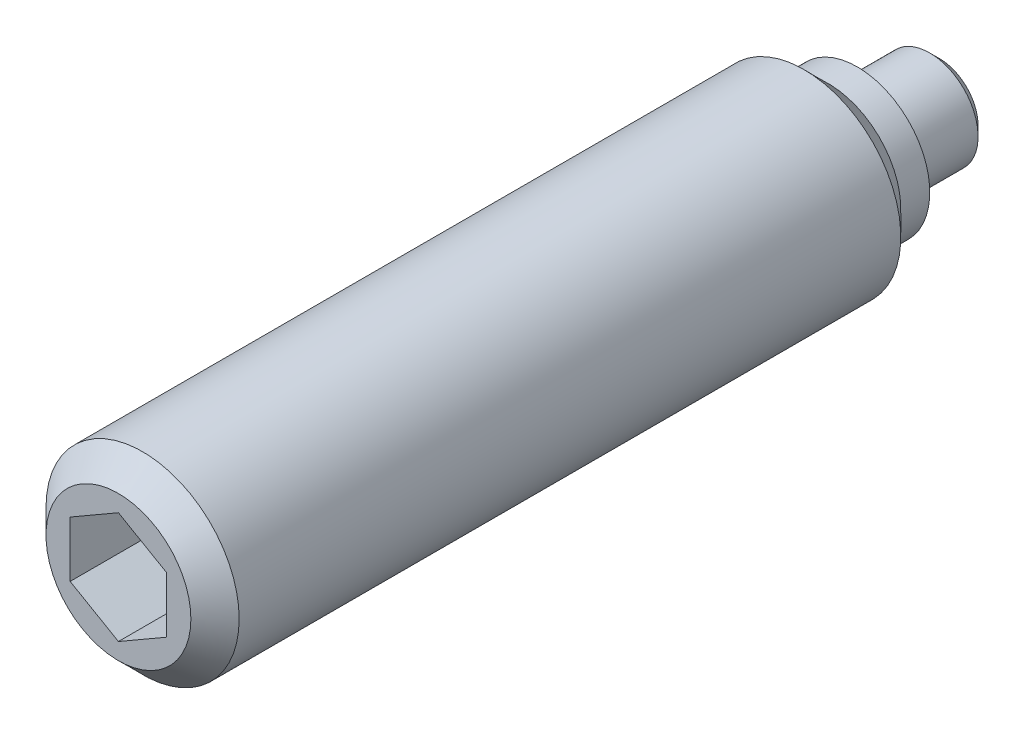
ISO-10303-21;
HEADER;
FILE_DESCRIPTION(('STEP AP214'),'2;1');
FILE_NAME('part.step','',(''),(''),'','','');
FILE_SCHEMA(('AUTOMOTIVE_DESIGN { 1 0 10303 214 1 1 1 1 }'));
ENDSEC;
DATA;
#1=APPLICATION_CONTEXT('core data for automotive mechanical design processes');
#2=APPLICATION_PROTOCOL_DEFINITION('international standard','automotive_design',2000,#1);
#3=PRODUCT_CONTEXT('',#1,'mechanical');
#4=PRODUCT('Part','Part','',(#3));
#5=PRODUCT_RELATED_PRODUCT_CATEGORY('part','',(#4));
#6=PRODUCT_DEFINITION_FORMATION('','',#4);
#7=PRODUCT_DEFINITION_CONTEXT('part definition',#1,'design');
#8=PRODUCT_DEFINITION('design','',#6,#7);
#9=PRODUCT_DEFINITION_SHAPE('','',#8);
#10=(LENGTH_UNIT() NAMED_UNIT(*) SI_UNIT(.MILLI.,.METRE.));
#11=(NAMED_UNIT(*) PLANE_ANGLE_UNIT() SI_UNIT($,.RADIAN.));
#12=(NAMED_UNIT(*) SI_UNIT($,.STERADIAN.) SOLID_ANGLE_UNIT());
#13=UNCERTAINTY_MEASURE_WITH_UNIT(LENGTH_MEASURE(1.E-05),#10,'distance_accuracy_value','');
#14=(GEOMETRIC_REPRESENTATION_CONTEXT(3) GLOBAL_UNCERTAINTY_ASSIGNED_CONTEXT((#13)) GLOBAL_UNIT_ASSIGNED_CONTEXT((#10,
#11,#12)) REPRESENTATION_CONTEXT('',''));
#15=CARTESIAN_POINT('',(0.,0.,0.));
#16=DIRECTION('',(0.,0.,1.));
#17=DIRECTION('',(1.,0.,0.));
#18=AXIS2_PLACEMENT_3D('',#15,#16,#17);
#19=CARTESIAN_POINT('',(0.,0.,0.));
#20=DIRECTION('',(0.,0.,-1.));
#21=DIRECTION('',(-1.,0.,0.));
#22=AXIS2_PLACEMENT_3D('',#19,#20,#21);
#23=CYLINDRICAL_SURFACE('',#22,1.);
#24=CARTESIAN_POINT('',(0.,0.,0.2));
#25=DIRECTION('',(0.,0.,-1.));
#26=DIRECTION('',(-1.,0.,0.));
#27=AXIS2_PLACEMENT_3D('',#24,#25,#26);
#28=CIRCLE('',#27,1.);
#29=CARTESIAN_POINT('',(-1.,0.,0.2));
#30=VERTEX_POINT('',#29);
#31=EDGE_CURVE('E133',#30,#30,#28,.T.);
#32=ORIENTED_EDGE('',*,*,#31,.F.);
#33=EDGE_LOOP('',(#32));
#34=FACE_BOUND('',#33,.T.);
#35=CARTESIAN_POINT('',(0.,0.,1.7));
#36=DIRECTION('',(0.,0.,-1.));
#37=DIRECTION('',(-1.,0.,0.));
#38=AXIS2_PLACEMENT_3D('',#35,#36,#37);
#39=CIRCLE('',#38,1.);
#40=CARTESIAN_POINT('',(-1.,0.,1.7));
#41=VERTEX_POINT('',#40);
#42=EDGE_CURVE('E127',#41,#41,#39,.T.);
#43=ORIENTED_EDGE('',*,*,#42,.T.);
#44=EDGE_LOOP('',(#43));
#45=FACE_BOUND('',#44,.T.);
#46=ADVANCED_FACE('F14',(#34,#45),#23,.T.);
#47=CARTESIAN_POINT('',(0.,0.,0.2));
#48=DIRECTION('',(0.,0.,1.));
#49=DIRECTION('',(1.,0.,0.));
#50=AXIS2_PLACEMENT_3D('',#47,#48,#49);
#51=CONICAL_SURFACE('',#50,1.,0.785398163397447);
#52=CARTESIAN_POINT('',(0.,0.,0.));
#53=DIRECTION('',(0.,0.,-1.));
#54=DIRECTION('',(-1.,0.,0.));
#55=AXIS2_PLACEMENT_3D('',#52,#53,#54);
#56=CIRCLE('',#55,0.8);
#57=CARTESIAN_POINT('',(-0.8,0.,0.));
#58=VERTEX_POINT('',#57);
#59=EDGE_CURVE('E130',#58,#58,#56,.T.);
#60=ORIENTED_EDGE('',*,*,#59,.F.);
#61=EDGE_LOOP('',(#60));
#62=FACE_BOUND('',#61,.T.);
#63=ORIENTED_EDGE('',*,*,#31,.T.);
#64=EDGE_LOOP('',(#63));
#65=FACE_BOUND('',#64,.T.);
#66=ADVANCED_FACE('F157',(#62,#65),#51,.T.);
#67=CARTESIAN_POINT('',(0.,0.8,0.));
#68=DIRECTION('',(0.,0.,1.));
#69=DIRECTION('',(1.,0.,0.));
#70=AXIS2_PLACEMENT_3D('',#67,#68,#69);
#71=PLANE('',#70);
#72=ORIENTED_EDGE('',*,*,#59,.T.);
#73=EDGE_LOOP('',(#72));
#74=FACE_BOUND('',#73,.T.);
#75=ADVANCED_FACE('F154',(#74),#71,.F.);
#76=CARTESIAN_POINT('',(0.,0.,1.7));
#77=DIRECTION('',(0.,0.,-1.));
#78=DIRECTION('',(-1.,0.,0.));
#79=AXIS2_PLACEMENT_3D('',#76,#77,#78);
#80=CYLINDRICAL_SURFACE('',#79,2.);
#81=CARTESIAN_POINT('',(0.,0.,2.8));
#82=DIRECTION('',(0.,0.,-1.));
#83=DIRECTION('',(-1.,0.,0.));
#84=AXIS2_PLACEMENT_3D('',#81,#82,#83);
#85=CIRCLE('',#84,2.);
#86=CARTESIAN_POINT('',(-2.,0.,2.8));
#87=VERTEX_POINT('',#86);
#88=EDGE_CURVE('E9',#87,#87,#85,.T.);
#89=ORIENTED_EDGE('',*,*,#88,.F.);
#90=EDGE_LOOP('',(#89));
#91=FACE_BOUND('',#90,.T.);
#92=CARTESIAN_POINT('',(0.,0.,16.5));
#93=DIRECTION('',(0.,0.,1.));
#94=DIRECTION('',(1.,0.,0.));
#95=AXIS2_PLACEMENT_3D('',#92,#93,#94);
#96=CIRCLE('',#95,2.);
#97=CARTESIAN_POINT('',(2.,0.,16.5));
#98=VERTEX_POINT('',#97);
#99=EDGE_CURVE('E124',#98,#98,#96,.T.);
#100=ORIENTED_EDGE('',*,*,#99,.F.);
#101=EDGE_LOOP('',(#100));
#102=FACE_BOUND('',#101,.T.);
#103=ADVANCED_FACE('F16',(#91,#102),#80,.T.);
#104=CARTESIAN_POINT('',(0.,0.,2.8));
#105=DIRECTION('',(0.,0.,1.));
#106=DIRECTION('',(1.,0.,0.));
#107=AXIS2_PLACEMENT_3D('',#104,#105,#106);
#108=CONICAL_SURFACE('',#107,2.,0.785398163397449);
#109=ORIENTED_EDGE('',*,*,#88,.T.);
#110=EDGE_LOOP('',(#109));
#111=FACE_BOUND('',#110,.T.);
#112=CARTESIAN_POINT('',(0.,0.,2.3));
#113=DIRECTION('',(0.,0.,-1.));
#114=DIRECTION('',(-1.,0.,0.));
#115=AXIS2_PLACEMENT_3D('',#112,#113,#114);
#116=CIRCLE('',#115,1.5);
#117=CARTESIAN_POINT('',(-1.5,0.,2.3));
#118=VERTEX_POINT('',#117);
#119=EDGE_CURVE('E22',#118,#118,#116,.T.);
#120=ORIENTED_EDGE('',*,*,#119,.F.);
#121=EDGE_LOOP('',(#120));
#122=FACE_BOUND('',#121,.T.);
#123=ADVANCED_FACE('F143',(#111,#122),#108,.T.);
#124=CARTESIAN_POINT('',(0.,0.,1.7));
#125=DIRECTION('',(0.,0.,-1.));
#126=DIRECTION('',(-1.,0.,0.));
#127=AXIS2_PLACEMENT_3D('',#124,#125,#126);
#128=CYLINDRICAL_SURFACE('',#127,1.5);
#129=CARTESIAN_POINT('',(0.,0.,1.7));
#130=DIRECTION('',(0.,0.,-1.));
#131=DIRECTION('',(-1.,0.,0.));
#132=AXIS2_PLACEMENT_3D('',#129,#130,#131);
#133=CIRCLE('',#132,1.5);
#134=CARTESIAN_POINT('',(-1.5,0.,1.7));
#135=VERTEX_POINT('',#134);
#136=EDGE_CURVE('E136',#135,#135,#133,.T.);
#137=ORIENTED_EDGE('',*,*,#136,.F.);
#138=EDGE_LOOP('',(#137));
#139=FACE_BOUND('',#138,.T.);
#140=ORIENTED_EDGE('',*,*,#119,.T.);
#141=EDGE_LOOP('',(#140));
#142=FACE_BOUND('',#141,.T.);
#143=ADVANCED_FACE('F141',(#139,#142),#128,.T.);
#144=CARTESIAN_POINT('',(0.,1.5,1.7));
#145=DIRECTION('',(0.,0.,1.));
#146=DIRECTION('',(1.,0.,0.));
#147=AXIS2_PLACEMENT_3D('',#144,#145,#146);
#148=PLANE('',#147);
#149=ORIENTED_EDGE('',*,*,#136,.T.);
#150=EDGE_LOOP('',(#149));
#151=FACE_BOUND('',#150,.T.);
#152=ORIENTED_EDGE('',*,*,#42,.F.);
#153=EDGE_LOOP('',(#152));
#154=FACE_BOUND('',#153,.T.);
#155=ADVANCED_FACE('F151',(#151,#154),#148,.F.);
#156=CARTESIAN_POINT('',(0.,-1.5,17.));
#157=DIRECTION('',(0.,0.,1.));
#158=DIRECTION('',(1.,0.,0.));
#159=AXIS2_PLACEMENT_3D('',#156,#157,#158);
#160=PLANE('',#159);
#161=DIRECTION('',(0.866025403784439,-0.5,0.));
#162=VECTOR('',#161,1.);
#163=CARTESIAN_POINT('',(-1.,-0.577350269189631,17.));
#164=LINE('',#163,#162);
#165=CARTESIAN_POINT('',(-1.,-0.577350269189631,17.));
#166=VERTEX_POINT('',#165);
#167=CARTESIAN_POINT('',(0.,-1.15470053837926,17.));
#168=VERTEX_POINT('',#167);
#169=EDGE_CURVE('E29',#166,#168,#164,.T.);
#170=ORIENTED_EDGE('',*,*,#169,.F.);
#171=DIRECTION('',(0.,-1.,0.));
#172=VECTOR('',#171,1.);
#173=CARTESIAN_POINT('',(-1.,0.577350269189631,17.));
#174=LINE('',#173,#172);
#175=CARTESIAN_POINT('',(-1.,0.577350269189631,17.));
#176=VERTEX_POINT('',#175);
#177=EDGE_CURVE('E112',#176,#166,#174,.T.);
#178=ORIENTED_EDGE('',*,*,#177,.F.);
#179=DIRECTION('',(-0.866025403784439,-0.5,0.));
#180=VECTOR('',#179,1.);
#181=CARTESIAN_POINT('',(0.,1.15470053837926,17.));
#182=LINE('',#181,#180);
#183=CARTESIAN_POINT('',(0.,1.15470053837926,17.));
#184=VERTEX_POINT('',#183);
#185=EDGE_CURVE('E110',#184,#176,#182,.T.);
#186=ORIENTED_EDGE('',*,*,#185,.F.);
#187=DIRECTION('',(-0.866025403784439,0.5,0.));
#188=VECTOR('',#187,1.);
#189=CARTESIAN_POINT('',(1.,0.577350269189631,17.));
#190=LINE('',#189,#188);
#191=CARTESIAN_POINT('',(1.,0.577350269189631,17.));
#192=VERTEX_POINT('',#191);
#193=EDGE_CURVE('E77',#192,#184,#190,.T.);
#194=ORIENTED_EDGE('',*,*,#193,.F.);
#195=DIRECTION('',(0.,1.,0.));
#196=VECTOR('',#195,1.);
#197=CARTESIAN_POINT('',(1.,-0.577350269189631,17.));
#198=LINE('',#197,#196);
#199=CARTESIAN_POINT('',(1.,-0.577350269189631,17.));
#200=VERTEX_POINT('',#199);
#201=EDGE_CURVE('E106',#200,#192,#198,.T.);
#202=ORIENTED_EDGE('',*,*,#201,.F.);
#203=DIRECTION('',(0.866025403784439,0.5,0.));
#204=VECTOR('',#203,1.);
#205=CARTESIAN_POINT('',(0.,-1.15470053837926,17.));
#206=LINE('',#205,#204);
#207=EDGE_CURVE('E103',#168,#200,#206,.T.);
#208=ORIENTED_EDGE('',*,*,#207,.F.);
#209=EDGE_LOOP('',(#170,#178,#186,#194,#202,#208));
#210=FACE_BOUND('',#209,.T.);
#211=CARTESIAN_POINT('',(0.,0.,17.));
#212=DIRECTION('',(0.,0.,1.));
#213=DIRECTION('',(1.,0.,0.));
#214=AXIS2_PLACEMENT_3D('',#211,#212,#213);
#215=CIRCLE('',#214,1.5);
#216=CARTESIAN_POINT('',(1.5,0.,17.));
#217=VERTEX_POINT('',#216);
#218=EDGE_CURVE('E116',#217,#217,#215,.T.);
#219=ORIENTED_EDGE('',*,*,#218,.T.);
#220=EDGE_LOOP('',(#219));
#221=FACE_BOUND('',#220,.T.);
#222=ADVANCED_FACE('F170',(#210,#221),#160,.T.);
#223=CARTESIAN_POINT('',(0.,0.,17.));
#224=DIRECTION('',(0.,0.,-1.));
#225=DIRECTION('',(-1.,0.,0.));
#226=AXIS2_PLACEMENT_3D('',#223,#224,#225);
#227=CONICAL_SURFACE('',#226,1.5,0.785398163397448);
#228=ORIENTED_EDGE('',*,*,#99,.T.);
#229=EDGE_LOOP('',(#228));
#230=FACE_BOUND('',#229,.T.);
#231=ORIENTED_EDGE('',*,*,#218,.F.);
#232=EDGE_LOOP('',(#231));
#233=FACE_BOUND('',#232,.T.);
#234=ADVANCED_FACE('F175',(#230,#233),#227,.T.);
#235=CARTESIAN_POINT('',(-1.,-0.577350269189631,14.5));
#236=DIRECTION('',(-0.5,-0.866025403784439,0.));
#237=DIRECTION('',(0.866025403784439,-0.5,0.));
#238=AXIS2_PLACEMENT_3D('',#235,#236,#237);
#239=PLANE('',#238);
#240=ORIENTED_EDGE('',*,*,#169,.T.);
#241=DIRECTION('',(0.,0.,1.));
#242=VECTOR('',#241,1.);
#243=CARTESIAN_POINT('',(0.,-1.15470053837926,14.5));
#244=LINE('',#243,#242);
#245=CARTESIAN_POINT('',(0.,-1.15470053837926,14.5));
#246=VERTEX_POINT('',#245);
#247=EDGE_CURVE('E59',#246,#168,#244,.T.);
#248=ORIENTED_EDGE('',*,*,#247,.F.);
#249=DIRECTION('',(0.866025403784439,-0.5,0.));
#250=VECTOR('',#249,1.);
#251=CARTESIAN_POINT('',(-1.,-0.577350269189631,14.5));
#252=LINE('',#251,#250);
#253=CARTESIAN_POINT('',(-1.,-0.577350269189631,14.5));
#254=VERTEX_POINT('',#253);
#255=EDGE_CURVE('E114',#254,#246,#252,.T.);
#256=ORIENTED_EDGE('',*,*,#255,.F.);
#257=DIRECTION('',(0.,0.,1.));
#258=VECTOR('',#257,1.);
#259=CARTESIAN_POINT('',(-1.,-0.577350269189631,14.5));
#260=LINE('',#259,#258);
#261=EDGE_CURVE('E37',#254,#166,#260,.T.);
#262=ORIENTED_EDGE('',*,*,#261,.T.);
#263=EDGE_LOOP('',(#240,#248,#256,#262));
#264=FACE_BOUND('',#263,.T.);
#265=ADVANCED_FACE('F184',(#264),#239,.F.);
#266=CARTESIAN_POINT('',(-1.,0.577350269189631,14.5));
#267=DIRECTION('',(-1.,0.,0.));
#268=DIRECTION('',(0.,0.,1.));
#269=AXIS2_PLACEMENT_3D('',#266,#267,#268);
#270=PLANE('',#269);
#271=ORIENTED_EDGE('',*,*,#177,.T.);
#272=ORIENTED_EDGE('',*,*,#261,.F.);
#273=DIRECTION('',(0.,-1.,0.));
#274=VECTOR('',#273,1.);
#275=CARTESIAN_POINT('',(-1.,0.577350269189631,14.5));
#276=LINE('',#275,#274);
#277=CARTESIAN_POINT('',(-1.,0.577350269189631,14.5));
#278=VERTEX_POINT('',#277);
#279=EDGE_CURVE('E89',#278,#254,#276,.T.);
#280=ORIENTED_EDGE('',*,*,#279,.F.);
#281=DIRECTION('',(0.,0.,1.));
#282=VECTOR('',#281,1.);
#283=CARTESIAN_POINT('',(-1.,0.577350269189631,14.5));
#284=LINE('',#283,#282);
#285=EDGE_CURVE('E81',#278,#176,#284,.T.);
#286=ORIENTED_EDGE('',*,*,#285,.T.);
#287=EDGE_LOOP('',(#271,#272,#280,#286));
#288=FACE_BOUND('',#287,.T.);
#289=ADVANCED_FACE('F244',(#288),#270,.F.);
#290=CARTESIAN_POINT('',(0.,1.15470053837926,14.5));
#291=DIRECTION('',(-0.5,0.866025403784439,0.));
#292=DIRECTION('',(-0.866025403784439,-0.5,0.));
#293=AXIS2_PLACEMENT_3D('',#290,#291,#292);
#294=PLANE('',#293);
#295=ORIENTED_EDGE('',*,*,#185,.T.);
#296=ORIENTED_EDGE('',*,*,#285,.F.);
#297=DIRECTION('',(-0.866025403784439,-0.5,0.));
#298=VECTOR('',#297,1.);
#299=CARTESIAN_POINT('',(0.,1.15470053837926,14.5));
#300=LINE('',#299,#298);
#301=CARTESIAN_POINT('',(0.,1.15470053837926,14.5));
#302=VERTEX_POINT('',#301);
#303=EDGE_CURVE('E85',#302,#278,#300,.T.);
#304=ORIENTED_EDGE('',*,*,#303,.F.);
#305=DIRECTION('',(0.,0.,1.));
#306=VECTOR('',#305,1.);
#307=CARTESIAN_POINT('',(0.,1.15470053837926,14.5));
#308=LINE('',#307,#306);
#309=EDGE_CURVE('E70',#302,#184,#308,.T.);
#310=ORIENTED_EDGE('',*,*,#309,.T.);
#311=EDGE_LOOP('',(#295,#296,#304,#310));
#312=FACE_BOUND('',#311,.T.);
#313=ADVANCED_FACE('F86',(#312),#294,.F.);
#314=CARTESIAN_POINT('',(1.,0.577350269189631,14.5));
#315=DIRECTION('',(0.5,0.866025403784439,0.));
#316=DIRECTION('',(-0.866025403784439,0.5,0.));
#317=AXIS2_PLACEMENT_3D('',#314,#315,#316);
#318=PLANE('',#317);
#319=ORIENTED_EDGE('',*,*,#193,.T.);
#320=ORIENTED_EDGE('',*,*,#309,.F.);
#321=DIRECTION('',(-0.866025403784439,0.5,0.));
#322=VECTOR('',#321,1.);
#323=CARTESIAN_POINT('',(1.,0.577350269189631,14.5));
#324=LINE('',#323,#322);
#325=CARTESIAN_POINT('',(1.,0.577350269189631,14.5));
#326=VERTEX_POINT('',#325);
#327=EDGE_CURVE('E74',#326,#302,#324,.T.);
#328=ORIENTED_EDGE('',*,*,#327,.F.);
#329=DIRECTION('',(0.,0.,1.));
#330=VECTOR('',#329,1.);
#331=CARTESIAN_POINT('',(1.,0.577350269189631,14.5));
#332=LINE('',#331,#330);
#333=EDGE_CURVE('E82',#326,#192,#332,.T.);
#334=ORIENTED_EDGE('',*,*,#333,.T.);
#335=EDGE_LOOP('',(#319,#320,#328,#334));
#336=FACE_BOUND('',#335,.T.);
#337=ADVANCED_FACE('F72',(#336),#318,.F.);
#338=CARTESIAN_POINT('',(1.,-0.577350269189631,14.5));
#339=DIRECTION('',(1.,0.,0.));
#340=DIRECTION('',(0.,0.,-1.));
#341=AXIS2_PLACEMENT_3D('',#338,#339,#340);
#342=PLANE('',#341);
#343=ORIENTED_EDGE('',*,*,#201,.T.);
#344=ORIENTED_EDGE('',*,*,#333,.F.);
#345=DIRECTION('',(0.,1.,0.));
#346=VECTOR('',#345,1.);
#347=CARTESIAN_POINT('',(1.,-0.577350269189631,14.5));
#348=LINE('',#347,#346);
#349=CARTESIAN_POINT('',(1.,-0.577350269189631,14.5));
#350=VERTEX_POINT('',#349);
#351=EDGE_CURVE('E95',#350,#326,#348,.T.);
#352=ORIENTED_EDGE('',*,*,#351,.F.);
#353=DIRECTION('',(0.,0.,1.));
#354=VECTOR('',#353,1.);
#355=CARTESIAN_POINT('',(1.,-0.577350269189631,14.5));
#356=LINE('',#355,#354);
#357=EDGE_CURVE('E119',#350,#200,#356,.T.);
#358=ORIENTED_EDGE('',*,*,#357,.T.);
#359=EDGE_LOOP('',(#343,#344,#352,#358));
#360=FACE_BOUND('',#359,.T.);
#361=ADVANCED_FACE('F268',(#360),#342,.F.);
#362=CARTESIAN_POINT('',(0.,-1.15470053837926,14.5));
#363=DIRECTION('',(0.5,-0.866025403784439,0.));
#364=DIRECTION('',(0.866025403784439,0.5,0.));
#365=AXIS2_PLACEMENT_3D('',#362,#363,#364);
#366=PLANE('',#365);
#367=ORIENTED_EDGE('',*,*,#207,.T.);
#368=ORIENTED_EDGE('',*,*,#357,.F.);
#369=DIRECTION('',(0.866025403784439,0.5,0.));
#370=VECTOR('',#369,1.);
#371=CARTESIAN_POINT('',(0.,-1.15470053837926,14.5));
#372=LINE('',#371,#370);
#373=EDGE_CURVE('E97',#246,#350,#372,.T.);
#374=ORIENTED_EDGE('',*,*,#373,.F.);
#375=ORIENTED_EDGE('',*,*,#247,.T.);
#376=EDGE_LOOP('',(#367,#368,#374,#375));
#377=FACE_BOUND('',#376,.T.);
#378=ADVANCED_FACE('F277',(#377),#366,.F.);
#379=CARTESIAN_POINT('',(0.,0.,14.5));
#380=DIRECTION('',(0.,0.,1.));
#381=DIRECTION('',(1.,0.,0.));
#382=AXIS2_PLACEMENT_3D('',#379,#380,#381);
#383=PLANE('',#382);
#384=ORIENTED_EDGE('',*,*,#255,.T.);
#385=ORIENTED_EDGE('',*,*,#373,.T.);
#386=ORIENTED_EDGE('',*,*,#351,.T.);
#387=ORIENTED_EDGE('',*,*,#327,.T.);
#388=ORIENTED_EDGE('',*,*,#303,.T.);
#389=ORIENTED_EDGE('',*,*,#279,.T.);
#390=EDGE_LOOP('',(#384,#385,#386,#387,#388,#389));
#391=FACE_BOUND('',#390,.T.);
#392=ADVANCED_FACE('F92',(#391),#383,.T.);
#393=CLOSED_SHELL('',(#46,#66,#75,#103,#123,#143,#155,#222,#234,#265,#289,#313,#337,#361,#378,#392));
#394=MANIFOLD_SOLID_BREP('B1',#393);
#395=ADVANCED_BREP_SHAPE_REPRESENTATION('',(#18,#394),#14);
#396=SHAPE_DEFINITION_REPRESENTATION(#9,#395);
ENDSEC;
END-ISO-10303-21;
